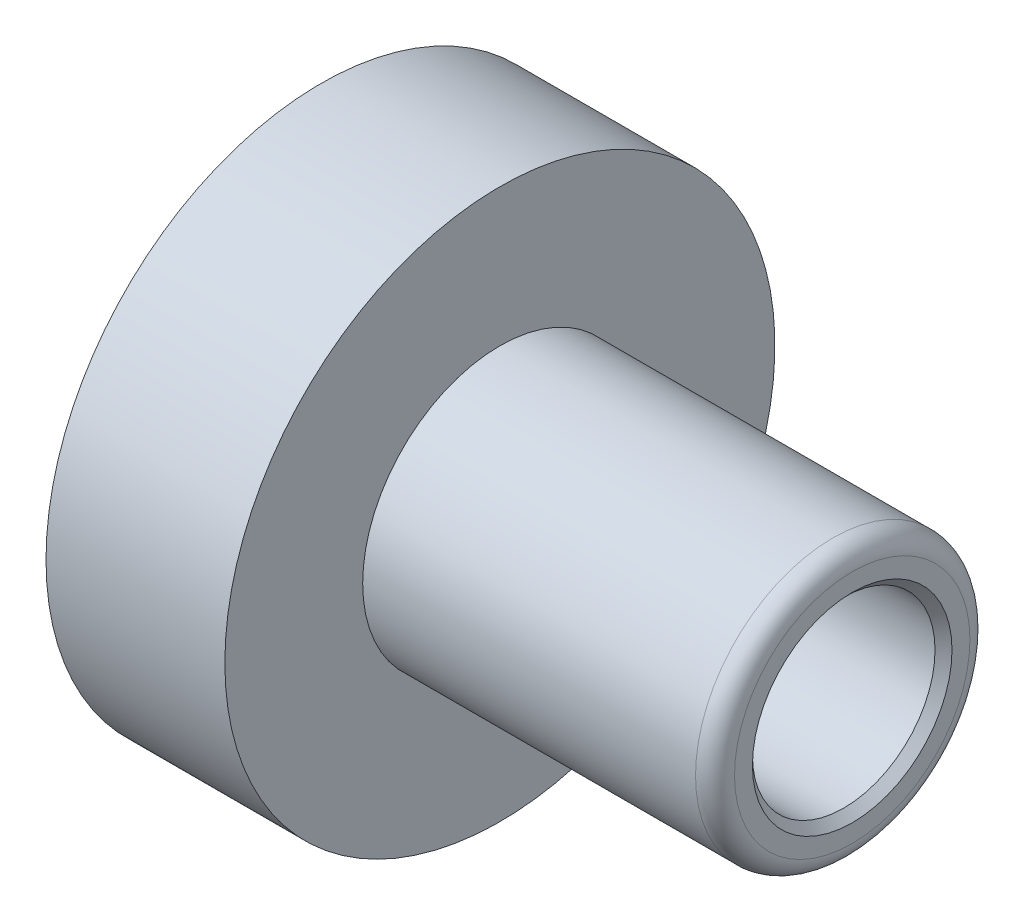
ISO-10303-21;
HEADER;
FILE_DESCRIPTION(('STEP AP214'),'2;1');
FILE_NAME('part.step','',(''),(''),'','','');
FILE_SCHEMA(('AUTOMOTIVE_DESIGN { 1 0 10303 214 1 1 1 1 }'));
ENDSEC;
DATA;
#1=APPLICATION_CONTEXT('core data for automotive mechanical design processes');
#2=APPLICATION_PROTOCOL_DEFINITION('international standard','automotive_design',2000,#1);
#3=PRODUCT_CONTEXT('',#1,'mechanical');
#4=PRODUCT('Part','Part','',(#3));
#5=PRODUCT_RELATED_PRODUCT_CATEGORY('part','',(#4));
#6=PRODUCT_DEFINITION_FORMATION('','',#4);
#7=PRODUCT_DEFINITION_CONTEXT('part definition',#1,'design');
#8=PRODUCT_DEFINITION('design','',#6,#7);
#9=PRODUCT_DEFINITION_SHAPE('','',#8);
#10=(LENGTH_UNIT() NAMED_UNIT(*) SI_UNIT(.MILLI.,.METRE.));
#11=(NAMED_UNIT(*) PLANE_ANGLE_UNIT() SI_UNIT($,.RADIAN.));
#12=(NAMED_UNIT(*) SI_UNIT($,.STERADIAN.) SOLID_ANGLE_UNIT());
#13=UNCERTAINTY_MEASURE_WITH_UNIT(LENGTH_MEASURE(1.E-05),#10,'distance_accuracy_value','');
#14=(GEOMETRIC_REPRESENTATION_CONTEXT(3) GLOBAL_UNCERTAINTY_ASSIGNED_CONTEXT((#13)) GLOBAL_UNIT_ASSIGNED_CONTEXT((#10,
#11,#12)) REPRESENTATION_CONTEXT('',''));
#15=CARTESIAN_POINT('',(0.,0.,0.));
#16=DIRECTION('',(0.,0.,1.));
#17=DIRECTION('',(1.,0.,0.));
#18=AXIS2_PLACEMENT_3D('',#15,#16,#17);
#19=CARTESIAN_POINT('',(0.,0.,0.));
#20=DIRECTION('',(-1.,0.,0.));
#21=DIRECTION('',(0.,0.,1.));
#22=AXIS2_PLACEMENT_3D('',#19,#20,#21);
#23=CYLINDRICAL_SURFACE('',#22,8.128);
#24=CARTESIAN_POINT('',(28.067,0.,0.));
#25=DIRECTION('',(-1.,0.,0.));
#26=DIRECTION('',(0.,0.,1.));
#27=AXIS2_PLACEMENT_3D('',#24,#25,#26);
#28=CIRCLE('',#27,8.128);
#29=CARTESIAN_POINT('',(28.067,0.,8.128));
#30=VERTEX_POINT('',#29);
#31=EDGE_CURVE('E42',#30,#30,#28,.T.);
#32=ORIENTED_EDGE('',*,*,#31,.F.);
#33=EDGE_LOOP('',(#32));
#34=FACE_BOUND('',#33,.T.);
#35=CARTESIAN_POINT('',(0.,0.,0.));
#36=DIRECTION('',(-1.,0.,0.));
#37=DIRECTION('',(0.,0.,1.));
#38=AXIS2_PLACEMENT_3D('',#35,#36,#37);
#39=CIRCLE('',#38,8.128);
#40=CARTESIAN_POINT('',(0.,0.,8.128));
#41=VERTEX_POINT('',#40);
#42=EDGE_CURVE('E63',#41,#41,#39,.T.);
#43=ORIENTED_EDGE('',*,*,#42,.T.);
#44=EDGE_LOOP('',(#43));
#45=FACE_BOUND('',#44,.T.);
#46=ADVANCED_FACE('F31',(#34,#45),#23,.F.);
#47=CARTESIAN_POINT('',(28.067,8.128,0.));
#48=DIRECTION('',(1.,0.,0.));
#49=DIRECTION('',(0.,0.,-1.));
#50=AXIS2_PLACEMENT_3D('',#47,#48,#49);
#51=PLANE('',#50);
#52=CARTESIAN_POINT('',(28.067,0.,0.));
#53=DIRECTION('',(1.,0.,0.));
#54=DIRECTION('',(0.,0.,-1.));
#55=AXIS2_PLACEMENT_3D('',#52,#53,#54);
#56=CIRCLE('',#55,7.3787);
#57=CARTESIAN_POINT('',(28.067,0.,-7.3787));
#58=VERTEX_POINT('',#57);
#59=EDGE_CURVE('E76',#58,#58,#56,.T.);
#60=ORIENTED_EDGE('',*,*,#59,.T.);
#61=EDGE_LOOP('',(#60));
#62=FACE_BOUND('',#61,.T.);
#63=ORIENTED_EDGE('',*,*,#31,.T.);
#64=EDGE_LOOP('',(#63));
#65=FACE_BOUND('',#64,.T.);
#66=ADVANCED_FACE('F82',(#62,#65),#51,.F.);
#67=CARTESIAN_POINT('',(42.926,9.5123,0.));
#68=DIRECTION('',(-1.,0.,0.));
#69=DIRECTION('',(0.,0.,1.));
#70=AXIS2_PLACEMENT_3D('',#67,#68,#69);
#71=PLANE('',#70);
#72=CARTESIAN_POINT('',(42.926,0.,0.));
#73=DIRECTION('',(-1.,0.,0.));
#74=DIRECTION('',(0.,0.,1.));
#75=AXIS2_PLACEMENT_3D('',#72,#73,#74);
#76=CIRCLE('',#75,8.0645);
#77=CARTESIAN_POINT('',(42.926,0.,8.0645));
#78=VERTEX_POINT('',#77);
#79=EDGE_CURVE('E10',#78,#78,#76,.T.);
#80=ORIENTED_EDGE('',*,*,#79,.T.);
#81=EDGE_LOOP('',(#80));
#82=FACE_BOUND('',#81,.T.);
#83=CARTESIAN_POINT('',(42.926,0.,0.));
#84=DIRECTION('',(-1.,0.,0.));
#85=DIRECTION('',(0.,0.,1.));
#86=AXIS2_PLACEMENT_3D('',#83,#84,#85);
#87=CIRCLE('',#86,9.5123);
#88=CARTESIAN_POINT('',(42.926,0.,9.5123));
#89=VERTEX_POINT('',#88);
#90=EDGE_CURVE('E46',#89,#89,#87,.T.);
#91=ORIENTED_EDGE('',*,*,#90,.F.);
#92=EDGE_LOOP('',(#91));
#93=FACE_BOUND('',#92,.T.);
#94=ADVANCED_FACE('F102',(#82,#93),#71,.F.);
#95=CARTESIAN_POINT('',(41.3512,0.,0.));
#96=DIRECTION('',(-1.,0.,0.));
#97=DIRECTION('',(0.,0.,1.));
#98=AXIS2_PLACEMENT_3D('',#95,#96,#97);
#99=TOROIDAL_SURFACE('',#98,9.5123,1.5748);
#100=CARTESIAN_POINT('',(41.3512,0.,0.));
#101=DIRECTION('',(-1.,0.,0.));
#102=DIRECTION('',(0.,0.,1.));
#103=AXIS2_PLACEMENT_3D('',#100,#101,#102);
#104=CIRCLE('',#103,11.0871);
#105=CARTESIAN_POINT('',(41.3512,0.,11.0871));
#106=VERTEX_POINT('',#105);
#107=EDGE_CURVE('E51',#106,#106,#104,.T.);
#108=ORIENTED_EDGE('',*,*,#107,.F.);
#109=EDGE_LOOP('',(#108));
#110=FACE_BOUND('',#109,.T.);
#111=ORIENTED_EDGE('',*,*,#90,.T.);
#112=EDGE_LOOP('',(#111));
#113=FACE_BOUND('',#112,.T.);
#114=ADVANCED_FACE('F109',(#110,#113),#99,.T.);
#115=CARTESIAN_POINT('',(0.,0.,0.));
#116=DIRECTION('',(-1.,0.,0.));
#117=DIRECTION('',(0.,0.,1.));
#118=AXIS2_PLACEMENT_3D('',#115,#116,#117);
#119=CYLINDRICAL_SURFACE('',#118,11.0871);
#120=CARTESIAN_POINT('',(14.4526,0.,0.));
#121=DIRECTION('',(-1.,0.,0.));
#122=DIRECTION('',(0.,0.,1.));
#123=AXIS2_PLACEMENT_3D('',#120,#121,#122);
#124=CIRCLE('',#123,11.0871);
#125=CARTESIAN_POINT('',(14.4526,0.,11.0871));
#126=VERTEX_POINT('',#125);
#127=EDGE_CURVE('E54',#126,#126,#124,.T.);
#128=ORIENTED_EDGE('',*,*,#127,.F.);
#129=EDGE_LOOP('',(#128));
#130=FACE_BOUND('',#129,.T.);
#131=ORIENTED_EDGE('',*,*,#107,.T.);
#132=EDGE_LOOP('',(#131));
#133=FACE_BOUND('',#132,.T.);
#134=ADVANCED_FACE('F112',(#130,#133),#119,.T.);
#135=CARTESIAN_POINT('',(14.4526,22.225,0.));
#136=DIRECTION('',(-1.,0.,0.));
#137=DIRECTION('',(0.,0.,1.));
#138=AXIS2_PLACEMENT_3D('',#135,#136,#137);
#139=PLANE('',#138);
#140=CARTESIAN_POINT('',(14.4526,0.,0.));
#141=DIRECTION('',(-1.,0.,0.));
#142=DIRECTION('',(0.,0.,1.));
#143=AXIS2_PLACEMENT_3D('',#140,#141,#142);
#144=CIRCLE('',#143,22.225);
#145=CARTESIAN_POINT('',(14.4526,0.,22.225));
#146=VERTEX_POINT('',#145);
#147=EDGE_CURVE('E57',#146,#146,#144,.T.);
#148=ORIENTED_EDGE('',*,*,#147,.F.);
#149=EDGE_LOOP('',(#148));
#150=FACE_BOUND('',#149,.T.);
#151=ORIENTED_EDGE('',*,*,#127,.T.);
#152=EDGE_LOOP('',(#151));
#153=FACE_BOUND('',#152,.T.);
#154=ADVANCED_FACE('F116',(#150,#153),#139,.F.);
#155=CARTESIAN_POINT('',(0.,0.,0.));
#156=DIRECTION('',(-1.,0.,0.));
#157=DIRECTION('',(0.,0.,1.));
#158=AXIS2_PLACEMENT_3D('',#155,#156,#157);
#159=CYLINDRICAL_SURFACE('',#158,22.225);
#160=CARTESIAN_POINT('',(0.,0.,0.));
#161=DIRECTION('',(-1.,0.,0.));
#162=DIRECTION('',(0.,0.,1.));
#163=AXIS2_PLACEMENT_3D('',#160,#161,#162);
#164=CIRCLE('',#163,22.225);
#165=CARTESIAN_POINT('',(0.,0.,22.225));
#166=VERTEX_POINT('',#165);
#167=EDGE_CURVE('E60',#166,#166,#164,.T.);
#168=ORIENTED_EDGE('',*,*,#167,.F.);
#169=EDGE_LOOP('',(#168));
#170=FACE_BOUND('',#169,.T.);
#171=ORIENTED_EDGE('',*,*,#147,.T.);
#172=EDGE_LOOP('',(#171));
#173=FACE_BOUND('',#172,.T.);
#174=ADVANCED_FACE('F120',(#170,#173),#159,.T.);
#175=CARTESIAN_POINT('',(0.,8.128,0.));
#176=DIRECTION('',(1.,0.,0.));
#177=DIRECTION('',(0.,0.,-1.));
#178=AXIS2_PLACEMENT_3D('',#175,#176,#177);
#179=PLANE('',#178);
#180=CARTESIAN_POINT('',(0.,0.,12.7));
#181=DIRECTION('',(-1.,0.,0.));
#182=DIRECTION('',(0.,0.,-1.));
#183=AXIS2_PLACEMENT_3D('',#180,#181,#182);
#184=CIRCLE('',#183,3.2004);
#185=CARTESIAN_POINT('',(0.,0.,9.4996));
#186=VERTEX_POINT('',#185);
#187=EDGE_CURVE('E73',#186,#186,#184,.T.);
#188=ORIENTED_EDGE('',*,*,#187,.F.);
#189=EDGE_LOOP('',(#188));
#190=FACE_BOUND('',#189,.T.);
#191=CARTESIAN_POINT('',(0.,0.,-12.7));
#192=DIRECTION('',(-1.,0.,0.));
#193=DIRECTION('',(0.,0.,1.));
#194=AXIS2_PLACEMENT_3D('',#191,#192,#193);
#195=CIRCLE('',#194,3.2004);
#196=CARTESIAN_POINT('',(0.,0.,-9.4996));
#197=VERTEX_POINT('',#196);
#198=EDGE_CURVE('E67',#197,#197,#195,.T.);
#199=ORIENTED_EDGE('',*,*,#198,.F.);
#200=EDGE_LOOP('',(#199));
#201=FACE_BOUND('',#200,.T.);
#202=ORIENTED_EDGE('',*,*,#42,.F.);
#203=EDGE_LOOP('',(#202));
#204=FACE_BOUND('',#203,.T.);
#205=ORIENTED_EDGE('',*,*,#167,.T.);
#206=EDGE_LOOP('',(#205));
#207=FACE_BOUND('',#206,.T.);
#208=ADVANCED_FACE('F124',(#190,#201,#204,#207),#179,.F.);
#209=CARTESIAN_POINT('',(7.9502,0.,-12.7));
#210=DIRECTION('',(-1.,0.,0.));
#211=DIRECTION('',(0.,0.,1.));
#212=AXIS2_PLACEMENT_3D('',#209,#210,#211);
#213=CYLINDRICAL_SURFACE('',#212,3.2004);
#214=CARTESIAN_POINT('',(7.9502,0.,-12.7));
#215=DIRECTION('',(-1.,0.,0.));
#216=DIRECTION('',(0.,0.,1.));
#217=AXIS2_PLACEMENT_3D('',#214,#215,#216);
#218=CIRCLE('',#217,3.2004);
#219=CARTESIAN_POINT('',(7.9502,0.,-9.4996));
#220=VERTEX_POINT('',#219);
#221=EDGE_CURVE('E66',#220,#220,#218,.T.);
#222=ORIENTED_EDGE('',*,*,#221,.F.);
#223=EDGE_LOOP('',(#222));
#224=FACE_BOUND('',#223,.T.);
#225=ORIENTED_EDGE('',*,*,#198,.T.);
#226=EDGE_LOOP('',(#225));
#227=FACE_BOUND('',#226,.T.);
#228=ADVANCED_FACE('F128',(#224,#227),#213,.F.);
#229=CARTESIAN_POINT('',(7.9502,0.,-12.7));
#230=DIRECTION('',(-1.,0.,0.));
#231=DIRECTION('',(0.,0.,1.));
#232=AXIS2_PLACEMENT_3D('',#229,#230,#231);
#233=PLANE('',#232);
#234=ORIENTED_EDGE('',*,*,#221,.T.);
#235=EDGE_LOOP('',(#234));
#236=FACE_BOUND('',#235,.T.);
#237=ADVANCED_FACE('F132',(#236),#233,.T.);
#238=CARTESIAN_POINT('',(7.9502,0.,12.7));
#239=DIRECTION('',(-1.,0.,0.));
#240=DIRECTION('',(0.,0.,1.));
#241=AXIS2_PLACEMENT_3D('',#238,#239,#240);
#242=CYLINDRICAL_SURFACE('',#241,3.2004);
#243=CARTESIAN_POINT('',(7.9502,0.,12.7));
#244=DIRECTION('',(-1.,0.,0.));
#245=DIRECTION('',(0.,0.,-1.));
#246=AXIS2_PLACEMENT_3D('',#243,#244,#245);
#247=CIRCLE('',#246,3.2004);
#248=CARTESIAN_POINT('',(7.9502,0.,9.4996));
#249=VERTEX_POINT('',#248);
#250=EDGE_CURVE('E70',#249,#249,#247,.T.);
#251=ORIENTED_EDGE('',*,*,#250,.F.);
#252=EDGE_LOOP('',(#251));
#253=FACE_BOUND('',#252,.T.);
#254=ORIENTED_EDGE('',*,*,#187,.T.);
#255=EDGE_LOOP('',(#254));
#256=FACE_BOUND('',#255,.T.);
#257=ADVANCED_FACE('F94',(#253,#256),#242,.F.);
#258=CARTESIAN_POINT('',(7.9502,0.,12.7));
#259=DIRECTION('',(1.,0.,0.));
#260=DIRECTION('',(0.,0.,-1.));
#261=AXIS2_PLACEMENT_3D('',#258,#259,#260);
#262=PLANE('',#261);
#263=ORIENTED_EDGE('',*,*,#250,.T.);
#264=EDGE_LOOP('',(#263));
#265=FACE_BOUND('',#264,.T.);
#266=ADVANCED_FACE('F87',(#265),#262,.F.);
#267=CARTESIAN_POINT('',(0.,0.,0.));
#268=DIRECTION('',(1.,0.,0.));
#269=DIRECTION('',(0.,0.,-1.));
#270=AXIS2_PLACEMENT_3D('',#267,#268,#269);
#271=CYLINDRICAL_SURFACE('',#270,7.3787);
#272=CARTESIAN_POINT('',(42.2402,0.,0.));
#273=DIRECTION('',(-1.,0.,0.));
#274=DIRECTION('',(0.,0.,1.));
#275=AXIS2_PLACEMENT_3D('',#272,#273,#274);
#276=CIRCLE('',#275,7.3787);
#277=CARTESIAN_POINT('',(42.2402,0.,7.3787));
#278=VERTEX_POINT('',#277);
#279=EDGE_CURVE('E38',#278,#278,#276,.F.);
#280=ORIENTED_EDGE('',*,*,#279,.T.);
#281=EDGE_LOOP('',(#280));
#282=FACE_BOUND('',#281,.T.);
#283=ORIENTED_EDGE('',*,*,#59,.F.);
#284=EDGE_LOOP('',(#283));
#285=FACE_BOUND('',#284,.T.);
#286=ADVANCED_FACE('F85',(#282,#285),#271,.F.);
#287=CARTESIAN_POINT('',(42.2402,0.,0.));
#288=DIRECTION('',(1.,0.,0.));
#289=DIRECTION('',(0.,0.,-1.));
#290=AXIS2_PLACEMENT_3D('',#287,#288,#289);
#291=CONICAL_SURFACE('',#290,7.3787,0.785398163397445);
#292=ORIENTED_EDGE('',*,*,#79,.F.);
#293=EDGE_LOOP('',(#292));
#294=FACE_BOUND('',#293,.T.);
#295=ORIENTED_EDGE('',*,*,#279,.F.);
#296=EDGE_LOOP('',(#295));
#297=FACE_BOUND('',#296,.T.);
#298=ADVANCED_FACE('F33',(#294,#297),#291,.F.);
#299=CLOSED_SHELL('',(#46,#66,#94,#114,#134,#154,#174,#208,#228,#237,#257,#266,#286,#298));
#300=MANIFOLD_SOLID_BREP('B2',#299);
#301=ADVANCED_BREP_SHAPE_REPRESENTATION('',(#18,#300),#14);
#302=SHAPE_DEFINITION_REPRESENTATION(#9,#301);
ENDSEC;
END-ISO-10303-21;
